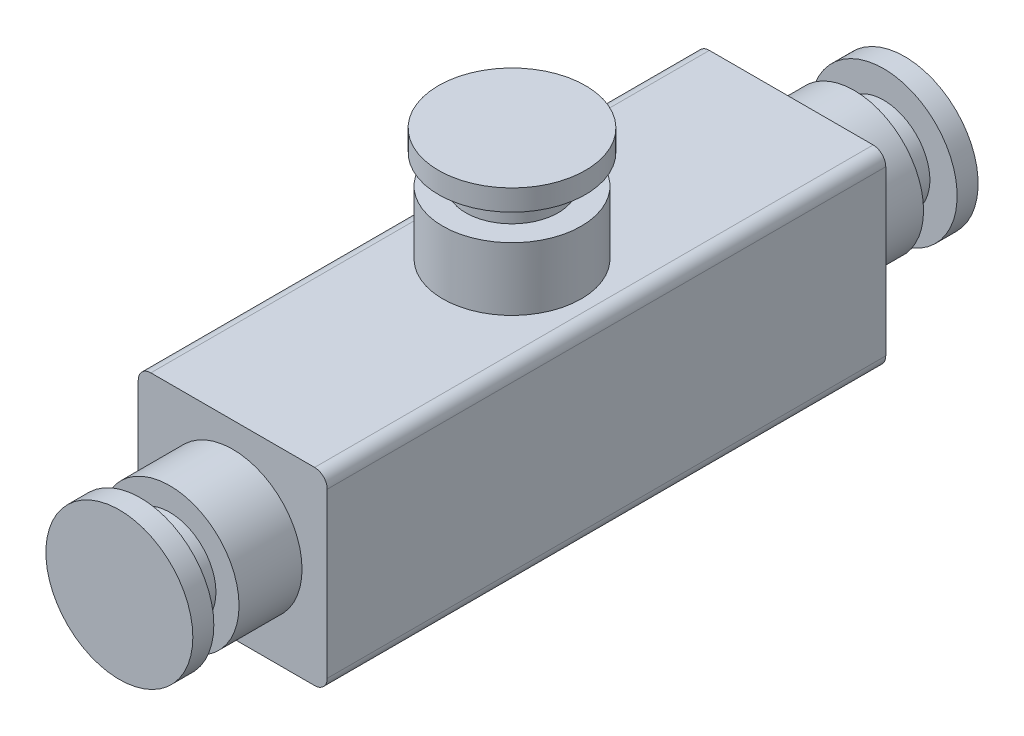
ISO-10303-21;
HEADER;
FILE_DESCRIPTION(('STEP AP214'),'2;1');
FILE_NAME('part.step','',(''),(''),'','','');
FILE_SCHEMA(('AUTOMOTIVE_DESIGN { 1 0 10303 214 1 1 1 1 }'));
ENDSEC;
DATA;
#1=APPLICATION_CONTEXT('core data for automotive mechanical design processes');
#2=APPLICATION_PROTOCOL_DEFINITION('international standard','automotive_design',2000,#1);
#3=PRODUCT_CONTEXT('',#1,'mechanical');
#4=PRODUCT('Part','Part','',(#3));
#5=PRODUCT_RELATED_PRODUCT_CATEGORY('part','',(#4));
#6=PRODUCT_DEFINITION_FORMATION('','',#4);
#7=PRODUCT_DEFINITION_CONTEXT('part definition',#1,'design');
#8=PRODUCT_DEFINITION('design','',#6,#7);
#9=PRODUCT_DEFINITION_SHAPE('','',#8);
#10=(LENGTH_UNIT() NAMED_UNIT(*) SI_UNIT(.MILLI.,.METRE.));
#11=(NAMED_UNIT(*) PLANE_ANGLE_UNIT() SI_UNIT($,.RADIAN.));
#12=(NAMED_UNIT(*) SI_UNIT($,.STERADIAN.) SOLID_ANGLE_UNIT());
#13=UNCERTAINTY_MEASURE_WITH_UNIT(LENGTH_MEASURE(1.E-05),#10,'distance_accuracy_value','');
#14=(GEOMETRIC_REPRESENTATION_CONTEXT(3) GLOBAL_UNCERTAINTY_ASSIGNED_CONTEXT((#13)) GLOBAL_UNIT_ASSIGNED_CONTEXT((#10,
#11,#12)) REPRESENTATION_CONTEXT('',''));
#15=CARTESIAN_POINT('',(0.,0.,0.));
#16=DIRECTION('',(0.,0.,1.));
#17=DIRECTION('',(1.,0.,0.));
#18=AXIS2_PLACEMENT_3D('',#15,#16,#17);
#19=CARTESIAN_POINT('',(-19.5,-19.5,133.));
#20=DIRECTION('',(0.,0.,-1.));
#21=DIRECTION('',(-1.,0.,0.));
#22=AXIS2_PLACEMENT_3D('',#19,#20,#21);
#23=CYLINDRICAL_SURFACE('',#22,3.);
#24=CARTESIAN_POINT('',(-19.5,-19.5,0.));
#25=DIRECTION('',(0.,0.,1.));
#26=DIRECTION('',(1.,0.,0.));
#27=AXIS2_PLACEMENT_3D('',#24,#25,#26);
#28=CIRCLE('',#27,3.);
#29=CARTESIAN_POINT('',(-22.5,-19.5,0.));
#30=VERTEX_POINT('',#29);
#31=CARTESIAN_POINT('',(-19.5,-22.5,0.));
#32=VERTEX_POINT('',#31);
#33=EDGE_CURVE('E134',#30,#32,#28,.T.);
#34=ORIENTED_EDGE('',*,*,#33,.T.);
#35=DIRECTION('',(0.,0.,-1.));
#36=VECTOR('',#35,1.);
#37=CARTESIAN_POINT('',(-19.5,-22.5,133.));
#38=LINE('',#37,#36);
#39=CARTESIAN_POINT('',(-19.5,-22.5,133.));
#40=VERTEX_POINT('',#39);
#41=EDGE_CURVE('E162',#40,#32,#38,.T.);
#42=ORIENTED_EDGE('',*,*,#41,.F.);
#43=CARTESIAN_POINT('',(-19.5,-19.5,133.));
#44=DIRECTION('',(0.,0.,1.));
#45=DIRECTION('',(1.,0.,0.));
#46=AXIS2_PLACEMENT_3D('',#43,#44,#45);
#47=CIRCLE('',#46,3.);
#48=CARTESIAN_POINT('',(-22.5,-19.5,133.));
#49=VERTEX_POINT('',#48);
#50=EDGE_CURVE('E149',#49,#40,#47,.T.);
#51=ORIENTED_EDGE('',*,*,#50,.F.);
#52=DIRECTION('',(0.,0.,-1.));
#53=VECTOR('',#52,1.);
#54=CARTESIAN_POINT('',(-22.5,-19.5,133.));
#55=LINE('',#54,#53);
#56=EDGE_CURVE('E130',#49,#30,#55,.T.);
#57=ORIENTED_EDGE('',*,*,#56,.T.);
#58=EDGE_LOOP('',(#34,#42,#51,#57));
#59=FACE_BOUND('',#58,.T.);
#60=ADVANCED_FACE('F37',(#59),#23,.T.);
#61=CARTESIAN_POINT('',(19.5,-22.5,133.));
#62=DIRECTION('',(0.,1.,0.));
#63=DIRECTION('',(-1.,0.,0.));
#64=AXIS2_PLACEMENT_3D('',#61,#62,#63);
#65=PLANE('',#64);
#66=CARTESIAN_POINT('',(0.,-22.5,34.5));
#67=DIRECTION('',(0.,-1.,0.));
#68=DIRECTION('',(1.,0.,0.));
#69=AXIS2_PLACEMENT_3D('',#66,#67,#68);
#70=CIRCLE('',#69,10.);
#71=CARTESIAN_POINT('',(10.,-22.5,34.5));
#72=VERTEX_POINT('',#71);
#73=EDGE_CURVE('E255',#72,#72,#70,.T.);
#74=ORIENTED_EDGE('',*,*,#73,.F.);
#75=EDGE_LOOP('',(#74));
#76=FACE_BOUND('',#75,.T.);
#77=DIRECTION('',(1.,0.,0.));
#78=VECTOR('',#77,1.);
#79=CARTESIAN_POINT('',(19.5,-22.5,0.));
#80=LINE('',#79,#78);
#81=CARTESIAN_POINT('',(19.5,-22.5,0.));
#82=VERTEX_POINT('',#81);
#83=EDGE_CURVE('E137',#32,#82,#80,.T.);
#84=ORIENTED_EDGE('',*,*,#83,.T.);
#85=DIRECTION('',(0.,0.,-1.));
#86=VECTOR('',#85,1.);
#87=CARTESIAN_POINT('',(19.5,-22.5,133.));
#88=LINE('',#87,#86);
#89=CARTESIAN_POINT('',(19.5,-22.5,133.));
#90=VERTEX_POINT('',#89);
#91=EDGE_CURVE('E159',#90,#82,#88,.T.);
#92=ORIENTED_EDGE('',*,*,#91,.F.);
#93=DIRECTION('',(1.,0.,0.));
#94=VECTOR('',#93,1.);
#95=CARTESIAN_POINT('',(19.5,-22.5,133.));
#96=LINE('',#95,#94);
#97=EDGE_CURVE('E97',#40,#90,#96,.T.);
#98=ORIENTED_EDGE('',*,*,#97,.F.);
#99=ORIENTED_EDGE('',*,*,#41,.T.);
#100=EDGE_LOOP('',(#84,#92,#98,#99));
#101=FACE_BOUND('',#100,.T.);
#102=ADVANCED_FACE('F181',(#76,#101),#65,.F.);
#103=CARTESIAN_POINT('',(19.5,-19.5,133.));
#104=DIRECTION('',(0.,0.,-1.));
#105=DIRECTION('',(-1.,0.,0.));
#106=AXIS2_PLACEMENT_3D('',#103,#104,#105);
#107=CYLINDRICAL_SURFACE('',#106,3.);
#108=CARTESIAN_POINT('',(19.5,-19.5,0.));
#109=DIRECTION('',(0.,0.,1.));
#110=DIRECTION('',(-1.,0.,0.));
#111=AXIS2_PLACEMENT_3D('',#108,#109,#110);
#112=CIRCLE('',#111,3.);
#113=CARTESIAN_POINT('',(22.5,-19.5,0.));
#114=VERTEX_POINT('',#113);
#115=EDGE_CURVE('E140',#82,#114,#112,.T.);
#116=ORIENTED_EDGE('',*,*,#115,.T.);
#117=DIRECTION('',(0.,0.,-1.));
#118=VECTOR('',#117,1.);
#119=CARTESIAN_POINT('',(22.5,-19.5,133.));
#120=LINE('',#119,#118);
#121=CARTESIAN_POINT('',(22.5,-19.5,133.));
#122=VERTEX_POINT('',#121);
#123=EDGE_CURVE('E156',#122,#114,#120,.T.);
#124=ORIENTED_EDGE('',*,*,#123,.F.);
#125=CARTESIAN_POINT('',(19.5,-19.5,133.));
#126=DIRECTION('',(0.,0.,1.));
#127=DIRECTION('',(-1.,0.,0.));
#128=AXIS2_PLACEMENT_3D('',#125,#126,#127);
#129=CIRCLE('',#128,3.);
#130=EDGE_CURVE('E199',#90,#122,#129,.T.);
#131=ORIENTED_EDGE('',*,*,#130,.F.);
#132=ORIENTED_EDGE('',*,*,#91,.T.);
#133=EDGE_LOOP('',(#116,#124,#131,#132));
#134=FACE_BOUND('',#133,.T.);
#135=ADVANCED_FACE('F187',(#134),#107,.T.);
#136=CARTESIAN_POINT('',(22.5,19.5,133.));
#137=DIRECTION('',(-1.,0.,0.));
#138=DIRECTION('',(0.,-1.,0.));
#139=AXIS2_PLACEMENT_3D('',#136,#137,#138);
#140=PLANE('',#139);
#141=DIRECTION('',(0.,1.,0.));
#142=VECTOR('',#141,1.);
#143=CARTESIAN_POINT('',(22.5,19.5,0.));
#144=LINE('',#143,#142);
#145=CARTESIAN_POINT('',(22.5,19.5,0.));
#146=VERTEX_POINT('',#145);
#147=EDGE_CURVE('E142',#114,#146,#144,.T.);
#148=ORIENTED_EDGE('',*,*,#147,.T.);
#149=DIRECTION('',(0.,0.,-1.));
#150=VECTOR('',#149,1.);
#151=CARTESIAN_POINT('',(22.5,19.5,133.));
#152=LINE('',#151,#150);
#153=CARTESIAN_POINT('',(22.5,19.5,133.));
#154=VERTEX_POINT('',#153);
#155=EDGE_CURVE('E153',#154,#146,#152,.T.);
#156=ORIENTED_EDGE('',*,*,#155,.F.);
#157=DIRECTION('',(0.,1.,0.));
#158=VECTOR('',#157,1.);
#159=CARTESIAN_POINT('',(22.5,19.5,133.));
#160=LINE('',#159,#158);
#161=EDGE_CURVE('E201',#122,#154,#160,.T.);
#162=ORIENTED_EDGE('',*,*,#161,.F.);
#163=ORIENTED_EDGE('',*,*,#123,.T.);
#164=EDGE_LOOP('',(#148,#156,#162,#163));
#165=FACE_BOUND('',#164,.T.);
#166=ADVANCED_FACE('F177',(#165),#140,.F.);
#167=CARTESIAN_POINT('',(19.5,19.5,133.));
#168=DIRECTION('',(0.,0.,-1.));
#169=DIRECTION('',(-1.,0.,0.));
#170=AXIS2_PLACEMENT_3D('',#167,#168,#169);
#171=CYLINDRICAL_SURFACE('',#170,3.);
#172=CARTESIAN_POINT('',(19.5,19.5,0.));
#173=DIRECTION('',(0.,0.,1.));
#174=DIRECTION('',(-1.,0.,0.));
#175=AXIS2_PLACEMENT_3D('',#172,#173,#174);
#176=CIRCLE('',#175,3.);
#177=CARTESIAN_POINT('',(19.5,22.5,0.));
#178=VERTEX_POINT('',#177);
#179=EDGE_CURVE('E144',#146,#178,#176,.T.);
#180=ORIENTED_EDGE('',*,*,#179,.T.);
#181=DIRECTION('',(0.,0.,-1.));
#182=VECTOR('',#181,1.);
#183=CARTESIAN_POINT('',(19.5,22.5,133.));
#184=LINE('',#183,#182);
#185=CARTESIAN_POINT('',(19.5,22.5,133.));
#186=VERTEX_POINT('',#185);
#187=EDGE_CURVE('E125',#186,#178,#184,.T.);
#188=ORIENTED_EDGE('',*,*,#187,.F.);
#189=CARTESIAN_POINT('',(19.5,19.5,133.));
#190=DIRECTION('',(0.,0.,1.));
#191=DIRECTION('',(-1.,0.,0.));
#192=AXIS2_PLACEMENT_3D('',#189,#190,#191);
#193=CIRCLE('',#192,3.);
#194=EDGE_CURVE('E116',#154,#186,#193,.T.);
#195=ORIENTED_EDGE('',*,*,#194,.F.);
#196=ORIENTED_EDGE('',*,*,#155,.T.);
#197=EDGE_LOOP('',(#180,#188,#195,#196));
#198=FACE_BOUND('',#197,.T.);
#199=ADVANCED_FACE('F169',(#198),#171,.T.);
#200=CARTESIAN_POINT('',(19.5,22.5,133.));
#201=DIRECTION('',(0.,-1.,0.));
#202=DIRECTION('',(1.,0.,0.));
#203=AXIS2_PLACEMENT_3D('',#200,#201,#202);
#204=PLANE('',#203);
#205=CARTESIAN_POINT('',(0.,22.5,66.5));
#206=DIRECTION('',(0.,-1.,0.));
#207=DIRECTION('',(1.,0.,0.));
#208=AXIS2_PLACEMENT_3D('',#205,#206,#207);
#209=CIRCLE('',#208,16.5);
#210=CARTESIAN_POINT('',(16.5,22.5,66.5));
#211=VERTEX_POINT('',#210);
#212=EDGE_CURVE('E45',#211,#211,#209,.F.);
#213=ORIENTED_EDGE('',*,*,#212,.F.);
#214=EDGE_LOOP('',(#213));
#215=FACE_BOUND('',#214,.T.);
#216=DIRECTION('',(-1.,0.,0.));
#217=VECTOR('',#216,1.);
#218=CARTESIAN_POINT('',(19.5,22.5,0.));
#219=LINE('',#218,#217);
#220=CARTESIAN_POINT('',(-19.5,22.5,0.));
#221=VERTEX_POINT('',#220);
#222=EDGE_CURVE('E124',#178,#221,#219,.T.);
#223=ORIENTED_EDGE('',*,*,#222,.T.);
#224=DIRECTION('',(0.,0.,-1.));
#225=VECTOR('',#224,1.);
#226=CARTESIAN_POINT('',(-19.5,22.5,133.));
#227=LINE('',#226,#225);
#228=CARTESIAN_POINT('',(-19.5,22.5,133.));
#229=VERTEX_POINT('',#228);
#230=EDGE_CURVE('E121',#229,#221,#227,.T.);
#231=ORIENTED_EDGE('',*,*,#230,.F.);
#232=DIRECTION('',(-1.,0.,0.));
#233=VECTOR('',#232,1.);
#234=CARTESIAN_POINT('',(19.5,22.5,133.));
#235=LINE('',#234,#233);
#236=EDGE_CURVE('E110',#186,#229,#235,.T.);
#237=ORIENTED_EDGE('',*,*,#236,.F.);
#238=ORIENTED_EDGE('',*,*,#187,.T.);
#239=EDGE_LOOP('',(#223,#231,#237,#238));
#240=FACE_BOUND('',#239,.T.);
#241=ADVANCED_FACE('F122',(#215,#240),#204,.F.);
#242=CARTESIAN_POINT('',(-19.5,19.5,133.));
#243=DIRECTION('',(0.,0.,-1.));
#244=DIRECTION('',(-1.,0.,0.));
#245=AXIS2_PLACEMENT_3D('',#242,#243,#244);
#246=CYLINDRICAL_SURFACE('',#245,3.);
#247=CARTESIAN_POINT('',(-19.5,19.5,0.));
#248=DIRECTION('',(0.,0.,1.));
#249=DIRECTION('',(-1.,0.,0.));
#250=AXIS2_PLACEMENT_3D('',#247,#248,#249);
#251=CIRCLE('',#250,3.);
#252=CARTESIAN_POINT('',(-22.5,19.5,0.));
#253=VERTEX_POINT('',#252);
#254=EDGE_CURVE('E82',#221,#253,#251,.T.);
#255=ORIENTED_EDGE('',*,*,#254,.T.);
#256=DIRECTION('',(0.,0.,-1.));
#257=VECTOR('',#256,1.);
#258=CARTESIAN_POINT('',(-22.5,19.5,133.));
#259=LINE('',#258,#257);
#260=CARTESIAN_POINT('',(-22.5,19.5,133.));
#261=VERTEX_POINT('',#260);
#262=EDGE_CURVE('E126',#261,#253,#259,.T.);
#263=ORIENTED_EDGE('',*,*,#262,.F.);
#264=CARTESIAN_POINT('',(-19.5,19.5,133.));
#265=DIRECTION('',(0.,0.,1.));
#266=DIRECTION('',(-1.,0.,0.));
#267=AXIS2_PLACEMENT_3D('',#264,#265,#266);
#268=CIRCLE('',#267,3.);
#269=EDGE_CURVE('E114',#229,#261,#268,.T.);
#270=ORIENTED_EDGE('',*,*,#269,.F.);
#271=ORIENTED_EDGE('',*,*,#230,.T.);
#272=EDGE_LOOP('',(#255,#263,#270,#271));
#273=FACE_BOUND('',#272,.T.);
#274=ADVANCED_FACE('F128',(#273),#246,.T.);
#275=CARTESIAN_POINT('',(-22.5,19.5,133.));
#276=DIRECTION('',(1.,0.,0.));
#277=DIRECTION('',(0.,1.,0.));
#278=AXIS2_PLACEMENT_3D('',#275,#276,#277);
#279=PLANE('',#278);
#280=DIRECTION('',(0.,-1.,0.));
#281=VECTOR('',#280,1.);
#282=CARTESIAN_POINT('',(-22.5,19.5,0.));
#283=LINE('',#282,#281);
#284=EDGE_CURVE('E88',#253,#30,#283,.T.);
#285=ORIENTED_EDGE('',*,*,#284,.T.);
#286=ORIENTED_EDGE('',*,*,#56,.F.);
#287=DIRECTION('',(0.,-1.,0.));
#288=VECTOR('',#287,1.);
#289=CARTESIAN_POINT('',(-22.5,19.5,133.));
#290=LINE('',#289,#288);
#291=EDGE_CURVE('E53',#261,#49,#290,.T.);
#292=ORIENTED_EDGE('',*,*,#291,.F.);
#293=ORIENTED_EDGE('',*,*,#262,.T.);
#294=EDGE_LOOP('',(#285,#286,#292,#293));
#295=FACE_BOUND('',#294,.T.);
#296=ADVANCED_FACE('F175',(#295),#279,.F.);
#297=CARTESIAN_POINT('',(-19.5,-19.5,133.));
#298=DIRECTION('',(0.,0.,1.));
#299=DIRECTION('',(1.,0.,0.));
#300=AXIS2_PLACEMENT_3D('',#297,#298,#299);
#301=PLANE('',#300);
#302=CARTESIAN_POINT('',(0.,0.,133.));
#303=DIRECTION('',(0.,0.,1.));
#304=DIRECTION('',(1.,0.,0.));
#305=AXIS2_PLACEMENT_3D('',#302,#303,#304);
#306=CIRCLE('',#305,16.5);
#307=CARTESIAN_POINT('',(16.5,0.,133.));
#308=VERTEX_POINT('',#307);
#309=EDGE_CURVE('E210',#308,#308,#306,.T.);
#310=ORIENTED_EDGE('',*,*,#309,.F.);
#311=EDGE_LOOP('',(#310));
#312=FACE_BOUND('',#311,.T.);
#313=ORIENTED_EDGE('',*,*,#50,.T.);
#314=ORIENTED_EDGE('',*,*,#97,.T.);
#315=ORIENTED_EDGE('',*,*,#130,.T.);
#316=ORIENTED_EDGE('',*,*,#161,.T.);
#317=ORIENTED_EDGE('',*,*,#194,.T.);
#318=ORIENTED_EDGE('',*,*,#236,.T.);
#319=ORIENTED_EDGE('',*,*,#269,.T.);
#320=ORIENTED_EDGE('',*,*,#291,.T.);
#321=EDGE_LOOP('',(#313,#314,#315,#316,#317,#318,#319,#320));
#322=FACE_BOUND('',#321,.T.);
#323=ADVANCED_FACE('F112',(#312,#322),#301,.T.);
#324=CARTESIAN_POINT('',(-19.5,-19.5,0.));
#325=DIRECTION('',(0.,0.,1.));
#326=DIRECTION('',(1.,0.,0.));
#327=AXIS2_PLACEMENT_3D('',#324,#325,#326);
#328=PLANE('',#327);
#329=CARTESIAN_POINT('',(0.,0.,0.));
#330=DIRECTION('',(0.,0.,1.));
#331=DIRECTION('',(1.,0.,0.));
#332=AXIS2_PLACEMENT_3D('',#329,#330,#331);
#333=CIRCLE('',#332,16.5);
#334=CARTESIAN_POINT('',(16.5,0.,0.));
#335=VERTEX_POINT('',#334);
#336=EDGE_CURVE('E11',#335,#335,#333,.F.);
#337=ORIENTED_EDGE('',*,*,#336,.F.);
#338=EDGE_LOOP('',(#337));
#339=FACE_BOUND('',#338,.T.);
#340=ORIENTED_EDGE('',*,*,#33,.F.);
#341=ORIENTED_EDGE('',*,*,#284,.F.);
#342=ORIENTED_EDGE('',*,*,#254,.F.);
#343=ORIENTED_EDGE('',*,*,#222,.F.);
#344=ORIENTED_EDGE('',*,*,#179,.F.);
#345=ORIENTED_EDGE('',*,*,#147,.F.);
#346=ORIENTED_EDGE('',*,*,#115,.F.);
#347=ORIENTED_EDGE('',*,*,#83,.F.);
#348=EDGE_LOOP('',(#340,#341,#342,#343,#344,#345,#346,#347));
#349=FACE_BOUND('',#348,.T.);
#350=ADVANCED_FACE('F193',(#339,#349),#328,.F.);
#351=CARTESIAN_POINT('',(0.,37.5,66.5));
#352=DIRECTION('',(0.,-1.,0.));
#353=DIRECTION('',(1.,0.,0.));
#354=AXIS2_PLACEMENT_3D('',#351,#352,#353);
#355=CYLINDRICAL_SURFACE('',#354,16.5);
#356=CARTESIAN_POINT('',(0.,37.5,66.5));
#357=DIRECTION('',(0.,1.,0.));
#358=DIRECTION('',(-1.,0.,0.));
#359=AXIS2_PLACEMENT_3D('',#356,#357,#358);
#360=CIRCLE('',#359,16.5);
#361=CARTESIAN_POINT('',(-16.5,37.5,66.5));
#362=VERTEX_POINT('',#361);
#363=EDGE_CURVE('E138',#362,#362,#360,.T.);
#364=ORIENTED_EDGE('',*,*,#363,.F.);
#365=EDGE_LOOP('',(#364));
#366=FACE_BOUND('',#365,.T.);
#367=ORIENTED_EDGE('',*,*,#212,.T.);
#368=EDGE_LOOP('',(#367));
#369=FACE_BOUND('',#368,.T.);
#370=ADVANCED_FACE('F166',(#366,#369),#355,.T.);
#371=CARTESIAN_POINT('',(0.,37.5,66.5));
#372=DIRECTION('',(0.,1.,0.));
#373=DIRECTION('',(-1.,0.,0.));
#374=AXIS2_PLACEMENT_3D('',#371,#372,#373);
#375=PLANE('',#374);
#376=CARTESIAN_POINT('',(0.,37.5,66.5));
#377=DIRECTION('',(0.,1.,0.));
#378=DIRECTION('',(-1.,0.,0.));
#379=AXIS2_PLACEMENT_3D('',#376,#377,#378);
#380=CIRCLE('',#379,11.);
#381=CARTESIAN_POINT('',(-11.,37.5,66.5));
#382=VERTEX_POINT('',#381);
#383=EDGE_CURVE('E219',#382,#382,#380,.T.);
#384=ORIENTED_EDGE('',*,*,#383,.F.);
#385=EDGE_LOOP('',(#384));
#386=FACE_BOUND('',#385,.T.);
#387=ORIENTED_EDGE('',*,*,#363,.T.);
#388=EDGE_LOOP('',(#387));
#389=FACE_BOUND('',#388,.T.);
#390=ADVANCED_FACE('F337',(#386,#389),#375,.T.);
#391=CARTESIAN_POINT('',(0.,0.,148.));
#392=DIRECTION('',(0.,0.,-1.));
#393=DIRECTION('',(-1.,0.,0.));
#394=AXIS2_PLACEMENT_3D('',#391,#392,#393);
#395=CYLINDRICAL_SURFACE('',#394,16.5);
#396=CARTESIAN_POINT('',(0.,0.,148.));
#397=DIRECTION('',(0.,0.,1.));
#398=DIRECTION('',(1.,0.,0.));
#399=AXIS2_PLACEMENT_3D('',#396,#397,#398);
#400=CIRCLE('',#399,16.5);
#401=CARTESIAN_POINT('',(16.5,0.,148.));
#402=VERTEX_POINT('',#401);
#403=EDGE_CURVE('E209',#402,#402,#400,.T.);
#404=ORIENTED_EDGE('',*,*,#403,.F.);
#405=EDGE_LOOP('',(#404));
#406=FACE_BOUND('',#405,.T.);
#407=ORIENTED_EDGE('',*,*,#309,.T.);
#408=EDGE_LOOP('',(#407));
#409=FACE_BOUND('',#408,.T.);
#410=ADVANCED_FACE('F333',(#406,#409),#395,.T.);
#411=CARTESIAN_POINT('',(0.,0.,148.));
#412=DIRECTION('',(0.,0.,1.));
#413=DIRECTION('',(1.,0.,0.));
#414=AXIS2_PLACEMENT_3D('',#411,#412,#413);
#415=PLANE('',#414);
#416=CARTESIAN_POINT('',(0.,0.,148.));
#417=DIRECTION('',(0.,0.,1.));
#418=DIRECTION('',(1.,0.,0.));
#419=AXIS2_PLACEMENT_3D('',#416,#417,#418);
#420=CIRCLE('',#419,11.);
#421=CARTESIAN_POINT('',(11.,0.,148.));
#422=VERTEX_POINT('',#421);
#423=EDGE_CURVE('E225',#422,#422,#420,.T.);
#424=ORIENTED_EDGE('',*,*,#423,.F.);
#425=EDGE_LOOP('',(#424));
#426=FACE_BOUND('',#425,.T.);
#427=ORIENTED_EDGE('',*,*,#403,.T.);
#428=EDGE_LOOP('',(#427));
#429=FACE_BOUND('',#428,.T.);
#430=ADVANCED_FACE('F329',(#426,#429),#415,.T.);
#431=CARTESIAN_POINT('',(0.,0.,-15.));
#432=DIRECTION('',(0.,0.,1.));
#433=DIRECTION('',(1.,0.,0.));
#434=AXIS2_PLACEMENT_3D('',#431,#432,#433);
#435=CYLINDRICAL_SURFACE('',#434,16.5);
#436=CARTESIAN_POINT('',(0.,0.,-15.));
#437=DIRECTION('',(0.,0.,-1.));
#438=DIRECTION('',(-1.,0.,0.));
#439=AXIS2_PLACEMENT_3D('',#436,#437,#438);
#440=CIRCLE('',#439,16.5);
#441=CARTESIAN_POINT('',(-16.5,0.,-15.));
#442=VERTEX_POINT('',#441);
#443=EDGE_CURVE('E213',#442,#442,#440,.T.);
#444=ORIENTED_EDGE('',*,*,#443,.F.);
#445=EDGE_LOOP('',(#444));
#446=FACE_BOUND('',#445,.T.);
#447=ORIENTED_EDGE('',*,*,#336,.T.);
#448=EDGE_LOOP('',(#447));
#449=FACE_BOUND('',#448,.T.);
#450=ADVANCED_FACE('F325',(#446,#449),#435,.T.);
#451=CARTESIAN_POINT('',(0.,0.,-15.));
#452=DIRECTION('',(0.,0.,-1.));
#453=DIRECTION('',(-1.,0.,0.));
#454=AXIS2_PLACEMENT_3D('',#451,#452,#453);
#455=PLANE('',#454);
#456=CARTESIAN_POINT('',(0.,0.,-15.));
#457=DIRECTION('',(0.,0.,-1.));
#458=DIRECTION('',(-1.,0.,0.));
#459=AXIS2_PLACEMENT_3D('',#456,#457,#458);
#460=CIRCLE('',#459,11.);
#461=CARTESIAN_POINT('',(-11.,0.,-15.));
#462=VERTEX_POINT('',#461);
#463=EDGE_CURVE('E231',#462,#462,#460,.T.);
#464=ORIENTED_EDGE('',*,*,#463,.F.);
#465=EDGE_LOOP('',(#464));
#466=FACE_BOUND('',#465,.T.);
#467=ORIENTED_EDGE('',*,*,#443,.T.);
#468=EDGE_LOOP('',(#467));
#469=FACE_BOUND('',#468,.T.);
#470=ADVANCED_FACE('F321',(#466,#469),#455,.T.);
#471=CARTESIAN_POINT('',(0.,44.5,66.5));
#472=DIRECTION('',(0.,-1.,0.));
#473=DIRECTION('',(1.,0.,0.));
#474=AXIS2_PLACEMENT_3D('',#471,#472,#473);
#475=CYLINDRICAL_SURFACE('',#474,11.);
#476=CARTESIAN_POINT('',(0.,44.5,66.5));
#477=DIRECTION('',(0.,1.,0.));
#478=DIRECTION('',(-1.,0.,0.));
#479=AXIS2_PLACEMENT_3D('',#476,#477,#478);
#480=CIRCLE('',#479,11.);
#481=CARTESIAN_POINT('',(-11.,44.5,66.5));
#482=VERTEX_POINT('',#481);
#483=EDGE_CURVE('E218',#482,#482,#480,.T.);
#484=ORIENTED_EDGE('',*,*,#483,.F.);
#485=EDGE_LOOP('',(#484));
#486=FACE_BOUND('',#485,.T.);
#487=ORIENTED_EDGE('',*,*,#383,.T.);
#488=EDGE_LOOP('',(#487));
#489=FACE_BOUND('',#488,.T.);
#490=ADVANCED_FACE('F317',(#486,#489),#475,.T.);
#491=CARTESIAN_POINT('',(0.,0.,155.));
#492=DIRECTION('',(0.,0.,-1.));
#493=DIRECTION('',(-1.,0.,0.));
#494=AXIS2_PLACEMENT_3D('',#491,#492,#493);
#495=CYLINDRICAL_SURFACE('',#494,11.);
#496=CARTESIAN_POINT('',(0.,0.,155.));
#497=DIRECTION('',(0.,0.,1.));
#498=DIRECTION('',(1.,0.,0.));
#499=AXIS2_PLACEMENT_3D('',#496,#497,#498);
#500=CIRCLE('',#499,11.);
#501=CARTESIAN_POINT('',(11.,0.,155.));
#502=VERTEX_POINT('',#501);
#503=EDGE_CURVE('E222',#502,#502,#500,.T.);
#504=ORIENTED_EDGE('',*,*,#503,.F.);
#505=EDGE_LOOP('',(#504));
#506=FACE_BOUND('',#505,.T.);
#507=ORIENTED_EDGE('',*,*,#423,.T.);
#508=EDGE_LOOP('',(#507));
#509=FACE_BOUND('',#508,.T.);
#510=ADVANCED_FACE('F313',(#506,#509),#495,.T.);
#511=CARTESIAN_POINT('',(0.,0.,-22.));
#512=DIRECTION('',(0.,0.,1.));
#513=DIRECTION('',(1.,0.,0.));
#514=AXIS2_PLACEMENT_3D('',#511,#512,#513);
#515=CYLINDRICAL_SURFACE('',#514,11.);
#516=CARTESIAN_POINT('',(0.,0.,-22.));
#517=DIRECTION('',(0.,0.,-1.));
#518=DIRECTION('',(-1.,0.,0.));
#519=AXIS2_PLACEMENT_3D('',#516,#517,#518);
#520=CIRCLE('',#519,11.);
#521=CARTESIAN_POINT('',(-11.,0.,-22.));
#522=VERTEX_POINT('',#521);
#523=EDGE_CURVE('E228',#522,#522,#520,.T.);
#524=ORIENTED_EDGE('',*,*,#523,.F.);
#525=EDGE_LOOP('',(#524));
#526=FACE_BOUND('',#525,.T.);
#527=ORIENTED_EDGE('',*,*,#463,.T.);
#528=EDGE_LOOP('',(#527));
#529=FACE_BOUND('',#528,.T.);
#530=ADVANCED_FACE('F309',(#526,#529),#515,.T.);
#531=CARTESIAN_POINT('',(0.,49.5,66.5));
#532=DIRECTION('',(0.,-1.,0.));
#533=DIRECTION('',(1.,0.,0.));
#534=AXIS2_PLACEMENT_3D('',#531,#532,#533);
#535=CYLINDRICAL_SURFACE('',#534,17.5);
#536=CARTESIAN_POINT('',(0.,49.5,66.5));
#537=DIRECTION('',(0.,1.,0.));
#538=DIRECTION('',(-1.,0.,0.));
#539=AXIS2_PLACEMENT_3D('',#536,#537,#538);
#540=CIRCLE('',#539,17.5);
#541=CARTESIAN_POINT('',(-17.5,49.5,66.5));
#542=VERTEX_POINT('',#541);
#543=EDGE_CURVE('E234',#542,#542,#540,.T.);
#544=ORIENTED_EDGE('',*,*,#543,.F.);
#545=EDGE_LOOP('',(#544));
#546=FACE_BOUND('',#545,.T.);
#547=CARTESIAN_POINT('',(0.,44.5,66.5));
#548=DIRECTION('',(0.,1.,0.));
#549=DIRECTION('',(-1.,0.,0.));
#550=AXIS2_PLACEMENT_3D('',#547,#548,#549);
#551=CIRCLE('',#550,17.5);
#552=CARTESIAN_POINT('',(-17.5,44.5,66.5));
#553=VERTEX_POINT('',#552);
#554=EDGE_CURVE('E237',#553,#553,#551,.T.);
#555=ORIENTED_EDGE('',*,*,#554,.T.);
#556=EDGE_LOOP('',(#555));
#557=FACE_BOUND('',#556,.T.);
#558=ADVANCED_FACE('F302',(#546,#557),#535,.T.);
#559=CARTESIAN_POINT('',(0.,49.5,66.5));
#560=DIRECTION('',(0.,1.,0.));
#561=DIRECTION('',(-1.,0.,0.));
#562=AXIS2_PLACEMENT_3D('',#559,#560,#561);
#563=PLANE('',#562);
#564=ORIENTED_EDGE('',*,*,#543,.T.);
#565=EDGE_LOOP('',(#564));
#566=FACE_BOUND('',#565,.T.);
#567=ADVANCED_FACE('F299',(#566),#563,.T.);
#568=CARTESIAN_POINT('',(0.,44.5,66.5));
#569=DIRECTION('',(0.,1.,0.));
#570=DIRECTION('',(-1.,0.,0.));
#571=AXIS2_PLACEMENT_3D('',#568,#569,#570);
#572=PLANE('',#571);
#573=ORIENTED_EDGE('',*,*,#483,.T.);
#574=EDGE_LOOP('',(#573));
#575=FACE_BOUND('',#574,.T.);
#576=ORIENTED_EDGE('',*,*,#554,.F.);
#577=EDGE_LOOP('',(#576));
#578=FACE_BOUND('',#577,.T.);
#579=ADVANCED_FACE('F297',(#575,#578),#572,.F.);
#580=CARTESIAN_POINT('',(0.,0.,-27.));
#581=DIRECTION('',(0.,0.,1.));
#582=DIRECTION('',(1.,0.,0.));
#583=AXIS2_PLACEMENT_3D('',#580,#581,#582);
#584=CYLINDRICAL_SURFACE('',#583,17.5);
#585=CARTESIAN_POINT('',(0.,0.,-27.));
#586=DIRECTION('',(0.,0.,-1.));
#587=DIRECTION('',(-1.,0.,0.));
#588=AXIS2_PLACEMENT_3D('',#585,#586,#587);
#589=CIRCLE('',#588,17.5);
#590=CARTESIAN_POINT('',(-17.5,0.,-27.));
#591=VERTEX_POINT('',#590);
#592=EDGE_CURVE('E240',#591,#591,#589,.T.);
#593=ORIENTED_EDGE('',*,*,#592,.F.);
#594=EDGE_LOOP('',(#593));
#595=FACE_BOUND('',#594,.T.);
#596=CARTESIAN_POINT('',(0.,0.,-22.));
#597=DIRECTION('',(0.,0.,-1.));
#598=DIRECTION('',(-1.,0.,0.));
#599=AXIS2_PLACEMENT_3D('',#596,#597,#598);
#600=CIRCLE('',#599,17.5);
#601=CARTESIAN_POINT('',(-17.5,0.,-22.));
#602=VERTEX_POINT('',#601);
#603=EDGE_CURVE('E243',#602,#602,#600,.T.);
#604=ORIENTED_EDGE('',*,*,#603,.T.);
#605=EDGE_LOOP('',(#604));
#606=FACE_BOUND('',#605,.T.);
#607=ADVANCED_FACE('F290',(#595,#606),#584,.T.);
#608=CARTESIAN_POINT('',(0.,0.,-27.));
#609=DIRECTION('',(0.,0.,-1.));
#610=DIRECTION('',(-1.,0.,0.));
#611=AXIS2_PLACEMENT_3D('',#608,#609,#610);
#612=PLANE('',#611);
#613=ORIENTED_EDGE('',*,*,#592,.T.);
#614=EDGE_LOOP('',(#613));
#615=FACE_BOUND('',#614,.T.);
#616=ADVANCED_FACE('F287',(#615),#612,.T.);
#617=CARTESIAN_POINT('',(0.,0.,-22.));
#618=DIRECTION('',(0.,0.,-1.));
#619=DIRECTION('',(-1.,0.,0.));
#620=AXIS2_PLACEMENT_3D('',#617,#618,#619);
#621=PLANE('',#620);
#622=ORIENTED_EDGE('',*,*,#523,.T.);
#623=EDGE_LOOP('',(#622));
#624=FACE_BOUND('',#623,.T.);
#625=ORIENTED_EDGE('',*,*,#603,.F.);
#626=EDGE_LOOP('',(#625));
#627=FACE_BOUND('',#626,.T.);
#628=ADVANCED_FACE('F285',(#624,#627),#621,.F.);
#629=CARTESIAN_POINT('',(0.,0.,160.));
#630=DIRECTION('',(0.,0.,-1.));
#631=DIRECTION('',(-1.,0.,0.));
#632=AXIS2_PLACEMENT_3D('',#629,#630,#631);
#633=CYLINDRICAL_SURFACE('',#632,17.5);
#634=CARTESIAN_POINT('',(0.,0.,160.));
#635=DIRECTION('',(0.,0.,1.));
#636=DIRECTION('',(1.,0.,0.));
#637=AXIS2_PLACEMENT_3D('',#634,#635,#636);
#638=CIRCLE('',#637,17.5);
#639=CARTESIAN_POINT('',(17.5,0.,160.));
#640=VERTEX_POINT('',#639);
#641=EDGE_CURVE('E246',#640,#640,#638,.T.);
#642=ORIENTED_EDGE('',*,*,#641,.F.);
#643=EDGE_LOOP('',(#642));
#644=FACE_BOUND('',#643,.T.);
#645=CARTESIAN_POINT('',(0.,0.,155.));
#646=DIRECTION('',(0.,0.,1.));
#647=DIRECTION('',(1.,0.,0.));
#648=AXIS2_PLACEMENT_3D('',#645,#646,#647);
#649=CIRCLE('',#648,17.5);
#650=CARTESIAN_POINT('',(17.5,0.,155.));
#651=VERTEX_POINT('',#650);
#652=EDGE_CURVE('E249',#651,#651,#649,.T.);
#653=ORIENTED_EDGE('',*,*,#652,.T.);
#654=EDGE_LOOP('',(#653));
#655=FACE_BOUND('',#654,.T.);
#656=ADVANCED_FACE('F280',(#644,#655),#633,.T.);
#657=CARTESIAN_POINT('',(0.,0.,160.));
#658=DIRECTION('',(0.,0.,1.));
#659=DIRECTION('',(1.,0.,0.));
#660=AXIS2_PLACEMENT_3D('',#657,#658,#659);
#661=PLANE('',#660);
#662=ORIENTED_EDGE('',*,*,#641,.T.);
#663=EDGE_LOOP('',(#662));
#664=FACE_BOUND('',#663,.T.);
#665=ADVANCED_FACE('F275',(#664),#661,.T.);
#666=CARTESIAN_POINT('',(0.,0.,155.));
#667=DIRECTION('',(0.,0.,1.));
#668=DIRECTION('',(1.,0.,0.));
#669=AXIS2_PLACEMENT_3D('',#666,#667,#668);
#670=PLANE('',#669);
#671=ORIENTED_EDGE('',*,*,#503,.T.);
#672=EDGE_LOOP('',(#671));
#673=FACE_BOUND('',#672,.T.);
#674=ORIENTED_EDGE('',*,*,#652,.F.);
#675=EDGE_LOOP('',(#674));
#676=FACE_BOUND('',#675,.T.);
#677=ADVANCED_FACE('F266',(#673,#676),#670,.F.);
#678=CARTESIAN_POINT('',(0.,-17.5,34.5));
#679=DIRECTION('',(0.,-1.,0.));
#680=DIRECTION('',(1.,0.,0.));
#681=AXIS2_PLACEMENT_3D('',#678,#679,#680);
#682=CYLINDRICAL_SURFACE('',#681,10.);
#683=CARTESIAN_POINT('',(0.,-17.5,34.5));
#684=DIRECTION('',(0.,-1.,0.));
#685=DIRECTION('',(1.,0.,0.));
#686=AXIS2_PLACEMENT_3D('',#683,#684,#685);
#687=CIRCLE('',#686,10.);
#688=CARTESIAN_POINT('',(10.,-17.5,34.5));
#689=VERTEX_POINT('',#688);
#690=EDGE_CURVE('E252',#689,#689,#687,.T.);
#691=ORIENTED_EDGE('',*,*,#690,.F.);
#692=EDGE_LOOP('',(#691));
#693=FACE_BOUND('',#692,.T.);
#694=ORIENTED_EDGE('',*,*,#73,.T.);
#695=EDGE_LOOP('',(#694));
#696=FACE_BOUND('',#695,.T.);
#697=ADVANCED_FACE('F263',(#693,#696),#682,.F.);
#698=CARTESIAN_POINT('',(0.,-17.5,34.5));
#699=DIRECTION('',(0.,-1.,0.));
#700=DIRECTION('',(1.,0.,0.));
#701=AXIS2_PLACEMENT_3D('',#698,#699,#700);
#702=PLANE('',#701);
#703=ORIENTED_EDGE('',*,*,#690,.T.);
#704=EDGE_LOOP('',(#703));
#705=FACE_BOUND('',#704,.T.);
#706=ADVANCED_FACE('F261',(#705),#702,.T.);
#707=CLOSED_SHELL('',(#60,#102,#135,#166,#199,#241,#274,#296,#323,#350,#370,#390,#410,#430,#450,
#470,#490,#510,#530,#558,#567,#579,#607,#616,#628,#656,#665,#677,#697,#706));
#708=MANIFOLD_SOLID_BREP('B2',#707);
#709=ADVANCED_BREP_SHAPE_REPRESENTATION('',(#18,#708),#14);
#710=SHAPE_DEFINITION_REPRESENTATION(#9,#709);
ENDSEC;
END-ISO-10303-21;
